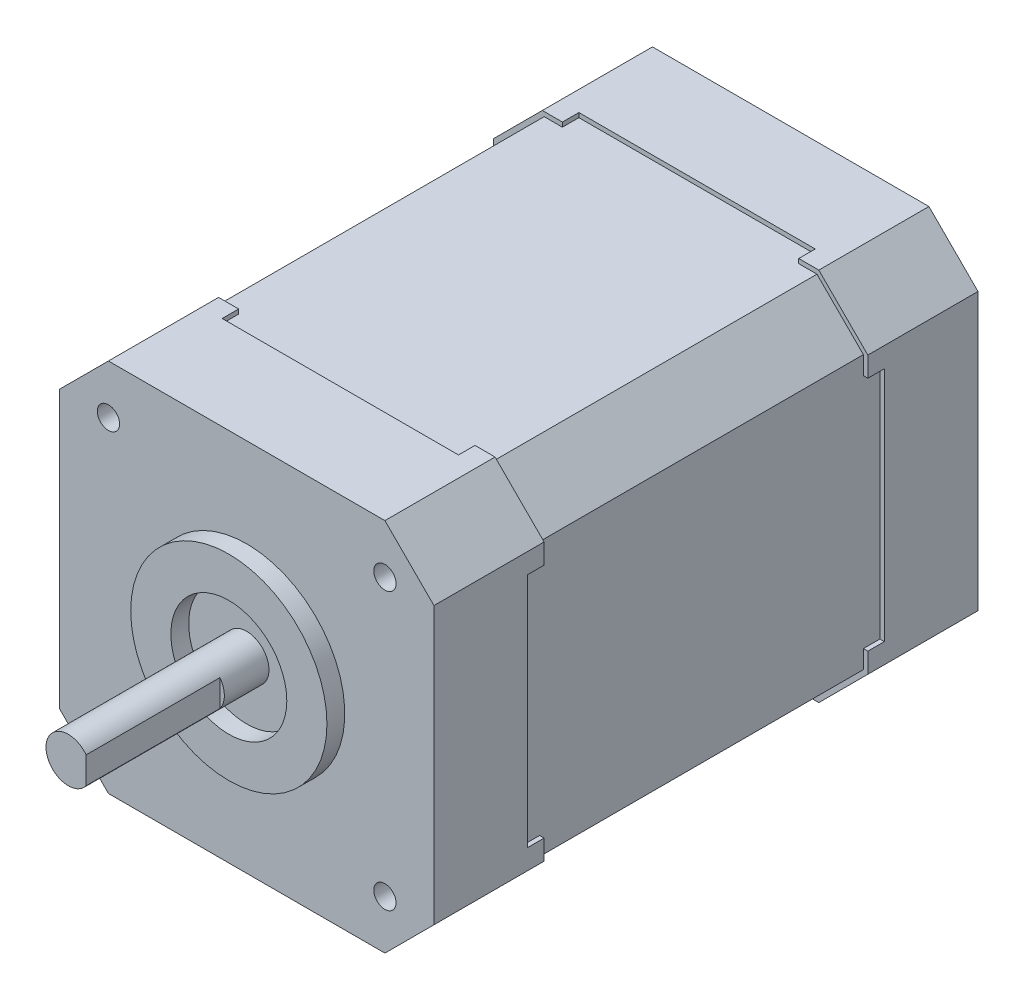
from build123d import *

# Parameters (mm, degrees)
EXTRUDE_1_DEPTH        = 61
SKETCH_2_R             = 11
SKETCH_2_R_2           = 6.5
EXTRUDE_2_DEPTH        = 2
SKETCH_3_R             = 2.5
EXTRUDE_3_DEPTH        = 20
CUT_EXTRUDE_START      = -15
CUT_EXTRUDE_1_DEPTH    = 15
SKETCH_6_W             = 36.3
SKETCH_6_H             = 0.5
SKETCH_7_W             = 26.5
SKETCH_7_H             = 40
CUT_EXTRUDE_2_DEPTH    = 0.5
SKETCH_8_W             = 40
SKETCH_8_H             = 26.5
CUT_EXTRUDE_3_DEPTH    = 0.5
SKETCH_9_W             = 26.5
SKETCH_9_H             = 40
CUT_EXTRUDE_4_DEPTH    = 0.5
SKETCH_10_W            = 40
SKETCH_10_H            = 26.5
CUT_EXTRUDE_5_DEPTH    = 0.5
HOLE_WIZARD_M3_1_D     = 2.5
HOLE_WIZARD_M3_1_DEPTH = 4.5
HOLE_WIZARD_M3_1_TIP   = 0.751075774
EXTRUDE_START          = 15
SKETCH_13_R            = 2.5
EXTRUDE_4_DEPTH        = 15
CHAMFER_1_SIZE         = 0.5


with BuildPart() as part:
    # Sketch 1 → Extrude 1 (new body)
    with BuildSketch(Plane.XY):
        Polygon((-21, 15.5), (-15.5, 21), (15.5, 21), (21, 15.5), (21, -15.5), (15.5, -21), (-15.5, -21), (-21, -15.5), align=None)
    extrude(amount=-EXTRUDE_1_DEPTH)

    # Sketch 2 → Extrude 2 (add)
    with BuildSketch(Plane.XY):
        with Locations(Location((0, 0, 0), (0, 0, 180))):
            Circle(SKETCH_2_R)
        Circle(SKETCH_2_R_2, mode=Mode.SUBTRACT)
    extrude(amount=EXTRUDE_2_DEPTH)

    # Sketch 3 → Extrude 3 (add)
    with BuildSketch(Plane.XY):
        with Locations(Location((0, 0, 0), (0, 0, 180))):
            Circle(SKETCH_3_R)
    extrude(amount=EXTRUDE_3_DEPTH)

    # Sketch 4 → Cut-Extrude 1 (cut)
    with BuildSketch(Plane.XY.offset(20).offset(CUT_EXTRUDE_START)):
        with BuildLine():
            Line((2, 1.5), (2, -1.5))
            ThreePointArc((2, -1.5), (2.5, 0), (2, 1.5))
        make_face()
    extrude(amount=CUT_EXTRUDE_1_DEPTH, mode=Mode.SUBTRACT)

    # Sweep 1: sweep along a path in Sketch 5
    with BuildLine(Plane.XY.offset(-12.35)) as sweep_1_path:
        Line((15.5, 21), (-15.5, 21))
        Line((-15.5, 21), (-21, 15.5))
        Line((-21, 15.5), (-21, -15.5))
        Line((-21, -15.5), (-15.5, -21))
        Line((-15.5, -21), (15.5, -21))
        Line((15.5, -21), (21, -15.5))
        Line((21, -15.5), (21, 15.5))
        Line((21, 15.5), (15.5, 21))
    # Sketch 6 → Sweep 1 (sweep, cut)
    with BuildSketch(Plane(origin=(0, 0, 0), x_dir=(0, 0, -1), z_dir=(1, 0, 0))):
        with Locations((30.5, 20.75)):
            Rectangle(SKETCH_6_W, SKETCH_6_H)
    sweep(path=sweep_1_path.line, transition=Transition.RIGHT, mode=Mode.SUBTRACT)

    # Sketch 7 → Cut-Extrude 2 (cut)
    with BuildSketch(Plane(origin=(0, 21, 0), x_dir=(1, 0, 0), z_dir=(0, 1, 0))):
        with Locations((0, 30.5)):
            Rectangle(SKETCH_7_W, SKETCH_7_H)
    extrude(amount=-CUT_EXTRUDE_2_DEPTH, mode=Mode.SUBTRACT)

    # Sketch 8 → Cut-Extrude 3 (cut)
    with BuildSketch(Plane(origin=(21, 0, 0), x_dir=(0, 0, -1), z_dir=(1, 0, 0))):
        with Locations((30.5, 0)):
            Rectangle(SKETCH_8_W, SKETCH_8_H)
    extrude(amount=-CUT_EXTRUDE_3_DEPTH, mode=Mode.SUBTRACT)

    # Sketch 9 → Cut-Extrude 4 (cut)
    with BuildSketch(Plane.XZ.offset(21)):
        with Locations((0, -30.5)):
            Rectangle(SKETCH_9_W, SKETCH_9_H)
    extrude(amount=-CUT_EXTRUDE_4_DEPTH, mode=Mode.SUBTRACT)

    # Sketch 10 → Cut-Extrude 5 (cut)
    with BuildSketch(Plane.ZY.offset(21)):
        with Locations((-30.5, 0)):
            Rectangle(SKETCH_10_W, SKETCH_10_H)
    extrude(amount=-CUT_EXTRUDE_5_DEPTH, mode=Mode.SUBTRACT)

    # Hole Wizard M3 _1
    with Locations(Plane.XY):
        with Locations((-15.5, 15.5), (15.5, 15.5), (15.5, -15.5), (-15.5, -15.5)):
            Hole(HOLE_WIZARD_M3_1_D / 2, depth=HOLE_WIZARD_M3_1_DEPTH)
            with Locations((0, 0, -(HOLE_WIZARD_M3_1_DEPTH + HOLE_WIZARD_M3_1_TIP / 2))):  # 118° drill point
                Cone(0, HOLE_WIZARD_M3_1_D / 2, HOLE_WIZARD_M3_1_TIP, mode=Mode.SUBTRACT)

    # Sketch 13 → Extrude 4 (add)
    with BuildSketch(Plane(origin=(0, 0, -61), x_dir=(-1, 0, 0), z_dir=(0, 0, -1)).offset(EXTRUDE_START)):
        Circle(SKETCH_13_R)
    extrude(amount=-EXTRUDE_4_DEPTH)

    # Chamfer 1
    chamfer_1_edges = [part.edges().sort_by_distance(p)[0] for p in [
        (2.5, 0, -76),
    ]]
    chamfer(chamfer_1_edges, length=CHAMFER_1_SIZE)


solid = part.part
